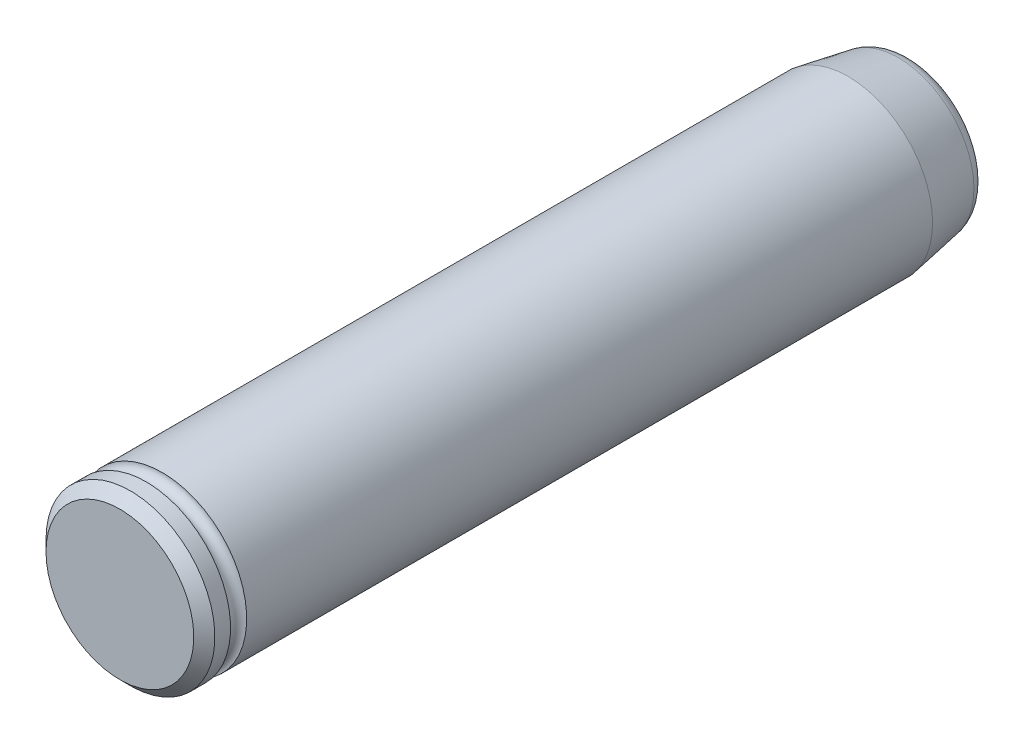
ISO-10303-21;
HEADER;
FILE_DESCRIPTION(('STEP AP214'),'2;1');
FILE_NAME('part.step','',(''),(''),'','','');
FILE_SCHEMA(('AUTOMOTIVE_DESIGN { 1 0 10303 214 1 1 1 1 }'));
ENDSEC;
DATA;
#1=APPLICATION_CONTEXT('core data for automotive mechanical design processes');
#2=APPLICATION_PROTOCOL_DEFINITION('international standard','automotive_design',2000,#1);
#3=PRODUCT_CONTEXT('',#1,'mechanical');
#4=PRODUCT('Part','Part','',(#3));
#5=PRODUCT_RELATED_PRODUCT_CATEGORY('part','',(#4));
#6=PRODUCT_DEFINITION_FORMATION('','',#4);
#7=PRODUCT_DEFINITION_CONTEXT('part definition',#1,'design');
#8=PRODUCT_DEFINITION('design','',#6,#7);
#9=PRODUCT_DEFINITION_SHAPE('','',#8);
#10=(LENGTH_UNIT() NAMED_UNIT(*) SI_UNIT(.MILLI.,.METRE.));
#11=(NAMED_UNIT(*) PLANE_ANGLE_UNIT() SI_UNIT($,.RADIAN.));
#12=(NAMED_UNIT(*) SI_UNIT($,.STERADIAN.) SOLID_ANGLE_UNIT());
#13=UNCERTAINTY_MEASURE_WITH_UNIT(LENGTH_MEASURE(1.E-05),#10,'distance_accuracy_value','');
#14=(GEOMETRIC_REPRESENTATION_CONTEXT(3) GLOBAL_UNCERTAINTY_ASSIGNED_CONTEXT((#13)) GLOBAL_UNIT_ASSIGNED_CONTEXT((#10,
#11,#12)) REPRESENTATION_CONTEXT('',''));
#15=CARTESIAN_POINT('',(0.,0.,0.));
#16=DIRECTION('',(0.,0.,1.));
#17=DIRECTION('',(1.,0.,0.));
#18=AXIS2_PLACEMENT_3D('',#15,#16,#17);
#19=CARTESIAN_POINT('',(0.,0.,150.));
#20=DIRECTION('',(0.,0.,-1.));
#21=DIRECTION('',(-1.,0.,0.));
#22=AXIS2_PLACEMENT_3D('',#19,#20,#21);
#23=CYLINDRICAL_SURFACE('',#22,16.);
#24=CARTESIAN_POINT('',(0.,0.,12.0000000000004));
#25=DIRECTION('',(0.,0.,1.));
#26=DIRECTION('',(1.,0.,0.));
#27=AXIS2_PLACEMENT_3D('',#24,#25,#26);
#28=CIRCLE('',#27,16.);
#29=CARTESIAN_POINT('',(-16.,0.,12.0000000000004));
#30=VERTEX_POINT('',#29);
#31=EDGE_CURVE('E39',#30,#30,#28,.T.);
#32=CARTESIAN_POINT('',(0.,0.,141.975));
#33=DIRECTION('',(0.,0.,1.));
#34=DIRECTION('',(1.,0.,0.));
#35=AXIS2_PLACEMENT_3D('',#32,#33,#34);
#36=CIRCLE('',#35,16.);
#37=CARTESIAN_POINT('',(-16.,0.,141.975));
#38=VERTEX_POINT('',#37);
#39=EDGE_CURVE('E30',#38,#38,#36,.T.);
#40=CARTESIAN_POINT('',(-16.,0.,12.0000000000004));
#41=CARTESIAN_POINT('',(-16.,0.,13.3539062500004));
#42=CARTESIAN_POINT('',(-16.,0.,14.7078125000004));
#43=CARTESIAN_POINT('',(-16.,0.,17.4156250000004));
#44=CARTESIAN_POINT('',(-16.,0.,18.7695312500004));
#45=CARTESIAN_POINT('',(-16.,0.,21.4773437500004));
#46=CARTESIAN_POINT('',(-16.,0.,22.8312500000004));
#47=CARTESIAN_POINT('',(-16.,0.,25.5390625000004));
#48=CARTESIAN_POINT('',(-16.,0.,26.8929687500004));
#49=CARTESIAN_POINT('',(-16.,0.,29.6007812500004));
#50=CARTESIAN_POINT('',(-16.,0.,30.9546875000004));
#51=CARTESIAN_POINT('',(-16.,0.,33.6625000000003));
#52=CARTESIAN_POINT('',(-16.,0.,35.0164062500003));
#53=CARTESIAN_POINT('',(-16.,0.,37.7242187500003));
#54=CARTESIAN_POINT('',(-16.,0.,39.0781250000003));
#55=CARTESIAN_POINT('',(-16.,0.,41.7859375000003));
#56=CARTESIAN_POINT('',(-16.,0.,43.1398437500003));
#57=CARTESIAN_POINT('',(-16.,0.,45.8476562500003));
#58=CARTESIAN_POINT('',(-16.,0.,47.2015625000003));
#59=CARTESIAN_POINT('',(-16.,0.,49.9093750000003));
#60=CARTESIAN_POINT('',(-16.,0.,51.2632812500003));
#61=CARTESIAN_POINT('',(-16.,0.,53.9710937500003));
#62=CARTESIAN_POINT('',(-16.,0.,55.3250000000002));
#63=CARTESIAN_POINT('',(-16.,0.,58.0328125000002));
#64=CARTESIAN_POINT('',(-16.,0.,59.3867187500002));
#65=CARTESIAN_POINT('',(-16.,0.,62.0945312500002));
#66=CARTESIAN_POINT('',(-16.,0.,63.4484375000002));
#67=CARTESIAN_POINT('',(-16.,0.,66.1562500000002));
#68=CARTESIAN_POINT('',(-16.,0.,67.5101562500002));
#69=CARTESIAN_POINT('',(-16.,0.,70.2179687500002));
#70=CARTESIAN_POINT('',(-16.,0.,71.5718750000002));
#71=CARTESIAN_POINT('',(-16.,0.,74.2796875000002));
#72=CARTESIAN_POINT('',(-16.,0.,75.6335937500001));
#73=CARTESIAN_POINT('',(-16.,0.,78.3414062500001));
#74=CARTESIAN_POINT('',(-16.,0.,79.6953125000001));
#75=CARTESIAN_POINT('',(-16.,0.,82.4031250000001));
#76=CARTESIAN_POINT('',(-16.,0.,83.7570312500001));
#77=CARTESIAN_POINT('',(-16.,0.,86.4648437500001));
#78=CARTESIAN_POINT('',(-16.,0.,87.8187500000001));
#79=CARTESIAN_POINT('',(-16.,0.,90.5265625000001));
#80=CARTESIAN_POINT('',(-16.,0.,91.8804687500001));
#81=CARTESIAN_POINT('',(-16.,0.,94.5882812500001));
#82=CARTESIAN_POINT('',(-16.,0.,95.9421875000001));
#83=CARTESIAN_POINT('',(-16.,0.,98.6500000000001));
#84=CARTESIAN_POINT('',(-16.,0.,100.00390625));
#85=CARTESIAN_POINT('',(-16.,0.,102.71171875));
#86=CARTESIAN_POINT('',(-16.,0.,104.065625));
#87=CARTESIAN_POINT('',(-16.,0.,106.7734375));
#88=CARTESIAN_POINT('',(-16.,0.,108.12734375));
#89=CARTESIAN_POINT('',(-16.,0.,110.83515625));
#90=CARTESIAN_POINT('',(-16.,0.,112.1890625));
#91=CARTESIAN_POINT('',(-16.,0.,114.896875));
#92=CARTESIAN_POINT('',(-16.,0.,116.25078125));
#93=CARTESIAN_POINT('',(-16.,0.,118.95859375));
#94=CARTESIAN_POINT('',(-16.,0.,120.3125));
#95=CARTESIAN_POINT('',(-16.,0.,123.0203125));
#96=CARTESIAN_POINT('',(-16.,0.,124.37421875));
#97=CARTESIAN_POINT('',(-16.,0.,127.08203125));
#98=CARTESIAN_POINT('',(-16.,0.,128.4359375));
#99=CARTESIAN_POINT('',(-16.,0.,131.14375));
#100=CARTESIAN_POINT('',(-16.,0.,132.49765625));
#101=CARTESIAN_POINT('',(-16.,0.,135.20546875));
#102=CARTESIAN_POINT('',(-16.,0.,136.559375));
#103=CARTESIAN_POINT('',(-16.,0.,139.2671875));
#104=CARTESIAN_POINT('',(-16.,0.,140.62109375));
#105=CARTESIAN_POINT('',(-16.,0.,141.975));
#106=B_SPLINE_CURVE_WITH_KNOTS('',3,(#40,#41,#42,#43,#44,#45,#46,#47,#48,#49,#50,#51,#52,#53,
#54,#55,#56,#57,#58,#59,#60,#61,#62,#63,#64,#65,#66,#67,#68,#69,#70,#71,#72,#73,#74,#75,#76,#77,
#78,#79,#80,#81,#82,#83,#84,#85,#86,#87,#88,#89,#90,#91,#92,#93,#94,#95,#96,#97,#98,#99,#100,
#101,#102,#103,#104,#105),.UNSPECIFIED.,.F.,.F.,(4,2,2,2,2,2,2,2,2,2,2,2,2,2,2,2,2,2,2,2,2,2,2,
2,2,2,2,2,2,2,2,2,4),(0.,4.06171874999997,8.12343749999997,12.1851562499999,16.2468749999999,
20.3085937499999,24.3703124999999,28.4320312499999,32.4937499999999,36.5554687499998,
40.6171874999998,44.6789062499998,48.7406249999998,52.8023437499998,56.8640624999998,
60.9257812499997,64.9874999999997,69.0492187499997,73.1109374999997,77.1726562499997,
81.2343749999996,85.2960937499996,89.3578124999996,93.4195312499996,97.4812499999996,
101.54296875,105.6046875,109.66640625,113.728124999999,117.789843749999,121.851562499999,
125.913281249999,129.974999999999),.UNSPECIFIED.);
#107=EDGE_CURVE('BSEAM27',#30,#38,#106,.T.);
#108=ORIENTED_EDGE('',*,*,#31,.T.);
#109=ORIENTED_EDGE('',*,*,#39,.F.);
#110=ORIENTED_EDGE('',*,*,#107,.T.);
#111=ORIENTED_EDGE('',*,*,#107,.F.);
#112=EDGE_LOOP('',(#108,#110,#109,#111));
#113=FACE_BOUND('',#112,.T.);
#114=ADVANCED_FACE('F27',(#113),#23,.T.);
#115=CARTESIAN_POINT('',(0.,0.,0.));
#116=DIRECTION('',(0.,0.,1.));
#117=DIRECTION('',(1.,0.,0.));
#118=AXIS2_PLACEMENT_3D('',#115,#116,#117);
#119=PLANE('',#118);
#120=CARTESIAN_POINT('',(0.,0.,0.));
#121=DIRECTION('',(0.,0.,1.));
#122=DIRECTION('',(1.,0.,0.));
#123=AXIS2_PLACEMENT_3D('',#120,#121,#122);
#124=CIRCLE('',#123,11.3667773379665);
#125=CARTESIAN_POINT('',(11.3667773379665,0.,0.));
#126=VERTEX_POINT('',#125);
#127=EDGE_CURVE('E34',#126,#126,#124,.F.);
#128=ORIENTED_EDGE('',*,*,#127,.T.);
#129=EDGE_LOOP('',(#128));
#130=FACE_BOUND('',#129,.T.);
#131=ADVANCED_FACE('F65',(#130),#119,.F.);
#132=CARTESIAN_POINT('',(0.,0.,12.0000000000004));
#133=DIRECTION('',(0.,0.,1.));
#134=DIRECTION('',(1.,0.,0.));
#135=AXIS2_PLACEMENT_3D('',#132,#133,#134);
#136=CONICAL_SURFACE('',#135,16.,0.17453292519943);
#137=CARTESIAN_POINT('',(0.,0.,2.47905546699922));
#138=DIRECTION('',(0.,0.,1.));
#139=DIRECTION('',(1.,0.,0.));
#140=AXIS2_PLACEMENT_3D('',#137,#138,#139);
#141=CIRCLE('',#140,14.3212005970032);
#142=CARTESIAN_POINT('',(14.3212005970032,0.,2.47905546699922));
#143=VERTEX_POINT('',#142);
#144=EDGE_CURVE('E10',#143,#143,#141,.T.);
#145=ORIENTED_EDGE('',*,*,#144,.T.);
#146=EDGE_LOOP('',(#145));
#147=FACE_BOUND('',#146,.T.);
#148=ORIENTED_EDGE('',*,*,#31,.F.);
#149=EDGE_LOOP('',(#148));
#150=FACE_BOUND('',#149,.T.);
#151=ADVANCED_FACE('F62',(#147,#150),#136,.T.);
#152=CARTESIAN_POINT('',(0.,0.,3.));
#153=DIRECTION('',(0.,0.,1.));
#154=DIRECTION('',(1.,0.,0.));
#155=AXIS2_PLACEMENT_3D('',#152,#153,#154);
#156=TOROIDAL_SURFACE('',#155,11.3667773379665,3.);
#157=ORIENTED_EDGE('',*,*,#144,.F.);
#158=EDGE_LOOP('',(#157));
#159=FACE_BOUND('',#158,.T.);
#160=ORIENTED_EDGE('',*,*,#127,.F.);
#161=EDGE_LOOP('',(#160));
#162=FACE_BOUND('',#161,.T.);
#163=ADVANCED_FACE('F64',(#159,#162),#156,.T.);
#164=CARTESIAN_POINT('',(0.,0.,143.5));
#165=DIRECTION('',(0.,0.,-1.));
#166=DIRECTION('',(-1.,0.,0.));
#167=AXIS2_PLACEMENT_3D('',#164,#165,#166);
#168=TOROIDAL_SURFACE('',#167,16.,1.52500000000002);
#169=CARTESIAN_POINT('',(0.,0.,145.025));
#170=DIRECTION('',(0.,0.,-1.));
#171=DIRECTION('',(-1.,0.,0.));
#172=AXIS2_PLACEMENT_3D('',#169,#170,#171);
#173=CIRCLE('',#172,16.);
#174=CARTESIAN_POINT('',(-16.,0.,145.025));
#175=VERTEX_POINT('',#174);
#176=EDGE_CURVE('E42',#175,#175,#173,.T.);
#177=ORIENTED_EDGE('',*,*,#176,.T.);
#178=EDGE_LOOP('',(#177));
#179=FACE_BOUND('',#178,.T.);
#180=ORIENTED_EDGE('',*,*,#39,.T.);
#181=EDGE_LOOP('',(#180));
#182=FACE_BOUND('',#181,.T.);
#183=ADVANCED_FACE('F71',(#179,#182),#168,.F.);
#184=CARTESIAN_POINT('',(0.,0.,150.));
#185=DIRECTION('',(0.,0.,1.));
#186=DIRECTION('',(1.,0.,0.));
#187=AXIS2_PLACEMENT_3D('',#184,#185,#186);
#188=PLANE('',#187);
#189=CARTESIAN_POINT('',(0.,0.,150.));
#190=DIRECTION('',(0.,0.,1.));
#191=DIRECTION('',(1.,0.,0.));
#192=AXIS2_PLACEMENT_3D('',#189,#190,#191);
#193=CIRCLE('',#192,14.);
#194=CARTESIAN_POINT('',(-14.,0.,150.));
#195=VERTEX_POINT('',#194);
#196=EDGE_CURVE('E47',#195,#195,#193,.T.);
#197=ORIENTED_EDGE('',*,*,#196,.T.);
#198=EDGE_LOOP('',(#197));
#199=FACE_BOUND('',#198,.T.);
#200=ADVANCED_FACE('F87',(#199),#188,.T.);
#201=CARTESIAN_POINT('',(0.,0.,150.));
#202=DIRECTION('',(0.,0.,-1.));
#203=DIRECTION('',(-1.,0.,0.));
#204=AXIS2_PLACEMENT_3D('',#201,#202,#203);
#205=CONICAL_SURFACE('',#204,14.,0.785398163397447);
#206=CARTESIAN_POINT('',(0.,0.,148.));
#207=DIRECTION('',(0.,0.,1.));
#208=DIRECTION('',(1.,0.,0.));
#209=AXIS2_PLACEMENT_3D('',#206,#207,#208);
#210=CIRCLE('',#209,16.);
#211=CARTESIAN_POINT('',(-16.,0.,148.));
#212=VERTEX_POINT('',#211);
#213=EDGE_CURVE('E51',#212,#212,#210,.F.);
#214=CARTESIAN_POINT('',(-16.,0.,148.));
#215=CARTESIAN_POINT('',(-15.9791666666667,0.,148.020833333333));
#216=CARTESIAN_POINT('',(-15.9583333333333,0.,148.041666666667));
#217=CARTESIAN_POINT('',(-15.9166666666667,0.,148.083333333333));
#218=CARTESIAN_POINT('',(-15.8958333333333,0.,148.104166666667));
#219=CARTESIAN_POINT('',(-15.8541666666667,0.,148.145833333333));
#220=CARTESIAN_POINT('',(-15.8333333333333,0.,148.166666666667));
#221=CARTESIAN_POINT('',(-15.7916666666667,0.,148.208333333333));
#222=CARTESIAN_POINT('',(-15.7708333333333,0.,148.229166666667));
#223=CARTESIAN_POINT('',(-15.7291666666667,0.,148.270833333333));
#224=CARTESIAN_POINT('',(-15.7083333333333,0.,148.291666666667));
#225=CARTESIAN_POINT('',(-15.6666666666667,0.,148.333333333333));
#226=CARTESIAN_POINT('',(-15.6458333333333,0.,148.354166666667));
#227=CARTESIAN_POINT('',(-15.6041666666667,0.,148.395833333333));
#228=CARTESIAN_POINT('',(-15.5833333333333,0.,148.416666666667));
#229=CARTESIAN_POINT('',(-15.5416666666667,0.,148.458333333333));
#230=CARTESIAN_POINT('',(-15.5208333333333,0.,148.479166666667));
#231=CARTESIAN_POINT('',(-15.4791666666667,0.,148.520833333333));
#232=CARTESIAN_POINT('',(-15.4583333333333,0.,148.541666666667));
#233=CARTESIAN_POINT('',(-15.4166666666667,0.,148.583333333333));
#234=CARTESIAN_POINT('',(-15.3958333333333,0.,148.604166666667));
#235=CARTESIAN_POINT('',(-15.3541666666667,0.,148.645833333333));
#236=CARTESIAN_POINT('',(-15.3333333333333,0.,148.666666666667));
#237=CARTESIAN_POINT('',(-15.2916666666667,0.,148.708333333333));
#238=CARTESIAN_POINT('',(-15.2708333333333,0.,148.729166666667));
#239=CARTESIAN_POINT('',(-15.2291666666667,0.,148.770833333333));
#240=CARTESIAN_POINT('',(-15.2083333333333,0.,148.791666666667));
#241=CARTESIAN_POINT('',(-15.1666666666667,0.,148.833333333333));
#242=CARTESIAN_POINT('',(-15.1458333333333,0.,148.854166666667));
#243=CARTESIAN_POINT('',(-15.1041666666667,0.,148.895833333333));
#244=CARTESIAN_POINT('',(-15.0833333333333,0.,148.916666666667));
#245=CARTESIAN_POINT('',(-15.0416666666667,0.,148.958333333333));
#246=CARTESIAN_POINT('',(-15.0208333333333,0.,148.979166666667));
#247=CARTESIAN_POINT('',(-14.9791666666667,0.,149.020833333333));
#248=CARTESIAN_POINT('',(-14.9583333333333,0.,149.041666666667));
#249=CARTESIAN_POINT('',(-14.9166666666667,0.,149.083333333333));
#250=CARTESIAN_POINT('',(-14.8958333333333,0.,149.104166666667));
#251=CARTESIAN_POINT('',(-14.8541666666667,0.,149.145833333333));
#252=CARTESIAN_POINT('',(-14.8333333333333,0.,149.166666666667));
#253=CARTESIAN_POINT('',(-14.7916666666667,0.,149.208333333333));
#254=CARTESIAN_POINT('',(-14.7708333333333,0.,149.229166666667));
#255=CARTESIAN_POINT('',(-14.7291666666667,0.,149.270833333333));
#256=CARTESIAN_POINT('',(-14.7083333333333,0.,149.291666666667));
#257=CARTESIAN_POINT('',(-14.6666666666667,0.,149.333333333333));
#258=CARTESIAN_POINT('',(-14.6458333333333,0.,149.354166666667));
#259=CARTESIAN_POINT('',(-14.6041666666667,0.,149.395833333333));
#260=CARTESIAN_POINT('',(-14.5833333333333,0.,149.416666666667));
#261=CARTESIAN_POINT('',(-14.5416666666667,0.,149.458333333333));
#262=CARTESIAN_POINT('',(-14.5208333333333,0.,149.479166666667));
#263=CARTESIAN_POINT('',(-14.4791666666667,0.,149.520833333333));
#264=CARTESIAN_POINT('',(-14.4583333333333,0.,149.541666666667));
#265=CARTESIAN_POINT('',(-14.4166666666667,0.,149.583333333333));
#266=CARTESIAN_POINT('',(-14.3958333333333,0.,149.604166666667));
#267=CARTESIAN_POINT('',(-14.3541666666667,0.,149.645833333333));
#268=CARTESIAN_POINT('',(-14.3333333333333,0.,149.666666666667));
#269=CARTESIAN_POINT('',(-14.2916666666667,0.,149.708333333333));
#270=CARTESIAN_POINT('',(-14.2708333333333,0.,149.729166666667));
#271=CARTESIAN_POINT('',(-14.2291666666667,0.,149.770833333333));
#272=CARTESIAN_POINT('',(-14.2083333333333,0.,149.791666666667));
#273=CARTESIAN_POINT('',(-14.1666666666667,0.,149.833333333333));
#274=CARTESIAN_POINT('',(-14.1458333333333,0.,149.854166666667));
#275=CARTESIAN_POINT('',(-14.1041666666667,0.,149.895833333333));
#276=CARTESIAN_POINT('',(-14.0833333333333,0.,149.916666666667));
#277=CARTESIAN_POINT('',(-14.0416666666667,0.,149.958333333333));
#278=CARTESIAN_POINT('',(-14.0208333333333,0.,149.979166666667));
#279=CARTESIAN_POINT('',(-14.,0.,150.));
#280=B_SPLINE_CURVE_WITH_KNOTS('',3,(#214,#215,#216,#217,#218,#219,#220,#221,#222,#223,#224,
#225,#226,#227,#228,#229,#230,#231,#232,#233,#234,#235,#236,#237,#238,#239,#240,#241,#242,#243,
#244,#245,#246,#247,#248,#249,#250,#251,#252,#253,#254,#255,#256,#257,#258,#259,#260,#261,#262,
#263,#264,#265,#266,#267,#268,#269,#270,#271,#272,#273,#274,#275,#276,#277,#278,#279),
.UNSPECIFIED.,.F.,.F.,(4,2,2,2,2,2,2,2,2,2,2,2,2,2,2,2,2,2,2,2,2,2,2,2,2,2,2,2,2,2,2,2,4),(0.,
0.0883883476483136,0.176776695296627,0.265165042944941,0.353553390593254,0.441941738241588,
0.5303300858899,0.618718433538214,0.707106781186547,0.79549512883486,0.883883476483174,
0.972271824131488,1.06066017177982,1.14904851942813,1.23743686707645,1.32582521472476,
1.41421356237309,1.50260191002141,1.59099025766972,1.67937860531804,1.76776695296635,
1.85615530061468,1.94454364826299,2.03293199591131,2.12132034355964,2.20970869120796,
2.29809703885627,2.38648538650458,2.47487373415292,2.56326208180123,2.65165042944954,
2.74003877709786,2.82842712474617),.UNSPECIFIED.);
#281=EDGE_CURVE('BSEAM82',#212,#195,#280,.T.);
#282=ORIENTED_EDGE('',*,*,#213,.F.);
#283=ORIENTED_EDGE('',*,*,#196,.F.);
#284=ORIENTED_EDGE('',*,*,#281,.T.);
#285=ORIENTED_EDGE('',*,*,#281,.F.);
#286=EDGE_LOOP('',(#282,#284,#283,#285));
#287=FACE_BOUND('',#286,.T.);
#288=ADVANCED_FACE('F82',(#287),#205,.T.);
#289=CARTESIAN_POINT('',(-16.,0.,148.));
#290=CARTESIAN_POINT('',(-16.,0.,147.969010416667));
#291=CARTESIAN_POINT('',(-16.,0.,147.938020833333));
#292=CARTESIAN_POINT('',(-16.,0.,147.876041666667));
#293=CARTESIAN_POINT('',(-16.,0.,147.845052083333));
#294=CARTESIAN_POINT('',(-16.,0.,147.783072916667));
#295=CARTESIAN_POINT('',(-16.,0.,147.752083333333));
#296=CARTESIAN_POINT('',(-16.,0.,147.690104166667));
#297=CARTESIAN_POINT('',(-16.,0.,147.659114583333));
#298=CARTESIAN_POINT('',(-16.,0.,147.597135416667));
#299=CARTESIAN_POINT('',(-16.,0.,147.566145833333));
#300=CARTESIAN_POINT('',(-16.,0.,147.504166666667));
#301=CARTESIAN_POINT('',(-16.,0.,147.473177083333));
#302=CARTESIAN_POINT('',(-16.,0.,147.411197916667));
#303=CARTESIAN_POINT('',(-16.,0.,147.380208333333));
#304=CARTESIAN_POINT('',(-16.,0.,147.318229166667));
#305=CARTESIAN_POINT('',(-16.,0.,147.287239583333));
#306=CARTESIAN_POINT('',(-16.,0.,147.225260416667));
#307=CARTESIAN_POINT('',(-16.,0.,147.194270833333));
#308=CARTESIAN_POINT('',(-16.,0.,147.132291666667));
#309=CARTESIAN_POINT('',(-16.,0.,147.101302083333));
#310=CARTESIAN_POINT('',(-16.,0.,147.039322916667));
#311=CARTESIAN_POINT('',(-16.,0.,147.008333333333));
#312=CARTESIAN_POINT('',(-16.,0.,146.946354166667));
#313=CARTESIAN_POINT('',(-16.,0.,146.915364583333));
#314=CARTESIAN_POINT('',(-16.,0.,146.853385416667));
#315=CARTESIAN_POINT('',(-16.,0.,146.822395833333));
#316=CARTESIAN_POINT('',(-16.,0.,146.760416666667));
#317=CARTESIAN_POINT('',(-16.,0.,146.729427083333));
#318=CARTESIAN_POINT('',(-16.,0.,146.667447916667));
#319=CARTESIAN_POINT('',(-16.,0.,146.636458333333));
#320=CARTESIAN_POINT('',(-16.,0.,146.574479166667));
#321=CARTESIAN_POINT('',(-16.,0.,146.543489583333));
#322=CARTESIAN_POINT('',(-16.,0.,146.481510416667));
#323=CARTESIAN_POINT('',(-16.,0.,146.450520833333));
#324=CARTESIAN_POINT('',(-16.,0.,146.388541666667));
#325=CARTESIAN_POINT('',(-16.,0.,146.357552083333));
#326=CARTESIAN_POINT('',(-16.,0.,146.295572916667));
#327=CARTESIAN_POINT('',(-16.,0.,146.264583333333));
#328=CARTESIAN_POINT('',(-16.,0.,146.202604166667));
#329=CARTESIAN_POINT('',(-16.,0.,146.171614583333));
#330=CARTESIAN_POINT('',(-16.,0.,146.109635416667));
#331=CARTESIAN_POINT('',(-16.,0.,146.078645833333));
#332=CARTESIAN_POINT('',(-16.,0.,146.016666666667));
#333=CARTESIAN_POINT('',(-16.,0.,145.985677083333));
#334=CARTESIAN_POINT('',(-16.,0.,145.923697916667));
#335=CARTESIAN_POINT('',(-16.,0.,145.892708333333));
#336=CARTESIAN_POINT('',(-16.,0.,145.830729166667));
#337=CARTESIAN_POINT('',(-16.,0.,145.799739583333));
#338=CARTESIAN_POINT('',(-16.,0.,145.737760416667));
#339=CARTESIAN_POINT('',(-16.,0.,145.706770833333));
#340=CARTESIAN_POINT('',(-16.,0.,145.644791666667));
#341=CARTESIAN_POINT('',(-16.,0.,145.613802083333));
#342=CARTESIAN_POINT('',(-16.,0.,145.551822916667));
#343=CARTESIAN_POINT('',(-16.,0.,145.520833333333));
#344=CARTESIAN_POINT('',(-16.,0.,145.458854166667));
#345=CARTESIAN_POINT('',(-16.,0.,145.427864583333));
#346=CARTESIAN_POINT('',(-16.,0.,145.365885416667));
#347=CARTESIAN_POINT('',(-16.,0.,145.334895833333));
#348=CARTESIAN_POINT('',(-16.,0.,145.272916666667));
#349=CARTESIAN_POINT('',(-16.,0.,145.241927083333));
#350=CARTESIAN_POINT('',(-16.,0.,145.179947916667));
#351=CARTESIAN_POINT('',(-16.,0.,145.148958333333));
#352=CARTESIAN_POINT('',(-16.,0.,145.086979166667));
#353=CARTESIAN_POINT('',(-16.,0.,145.055989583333));
#354=CARTESIAN_POINT('',(-16.,0.,145.025));
#355=B_SPLINE_CURVE_WITH_KNOTS('',3,(#289,#290,#291,#292,#293,#294,#295,#296,#297,#298,#299,
#300,#301,#302,#303,#304,#305,#306,#307,#308,#309,#310,#311,#312,#313,#314,#315,#316,#317,#318,
#319,#320,#321,#322,#323,#324,#325,#326,#327,#328,#329,#330,#331,#332,#333,#334,#335,#336,#337,
#338,#339,#340,#341,#342,#343,#344,#345,#346,#347,#348,#349,#350,#351,#352,#353,#354),
.UNSPECIFIED.,.F.,.F.,(4,2,2,2,2,2,2,2,2,2,2,2,2,2,2,2,2,2,2,2,2,2,2,2,2,2,2,2,2,2,2,2,4),(0.,
0.0929687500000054,0.185937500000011,0.278906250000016,0.371875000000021,0.464843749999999,
0.557812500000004,0.65078125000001,0.743750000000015,0.836718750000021,0.929687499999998,
1.02265625,1.11562500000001,1.20859375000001,1.30156249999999,1.39453125,1.4875,
1.58046875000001,1.67343750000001,1.76640624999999,1.859375,1.95234375,2.04531250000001,
2.13828124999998,2.23124999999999,2.32421875,2.4171875,2.51015625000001,2.60312499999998,
2.69609374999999,2.78906249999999,2.88203125,2.97499999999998),.UNSPECIFIED.);
#356=EDGE_CURVE('BSEAM78',#212,#175,#355,.T.);
#357=ORIENTED_EDGE('',*,*,#213,.T.);
#358=ORIENTED_EDGE('',*,*,#176,.F.);
#359=ORIENTED_EDGE('',*,*,#356,.T.);
#360=ORIENTED_EDGE('',*,*,#356,.F.);
#361=EDGE_LOOP('',(#357,#359,#358,#360));
#362=FACE_BOUND('',#361,.T.);
#363=ADVANCED_FACE('F78',(#362),#23,.T.);
#364=CLOSED_SHELL('',(#114,#131,#151,#163,#183,#200,#288,#363));
#365=MANIFOLD_SOLID_BREP('B2',#364);
#366=ADVANCED_BREP_SHAPE_REPRESENTATION('',(#18,#365),#14);
#367=SHAPE_DEFINITION_REPRESENTATION(#9,#366);
ENDSEC;
END-ISO-10303-21;
